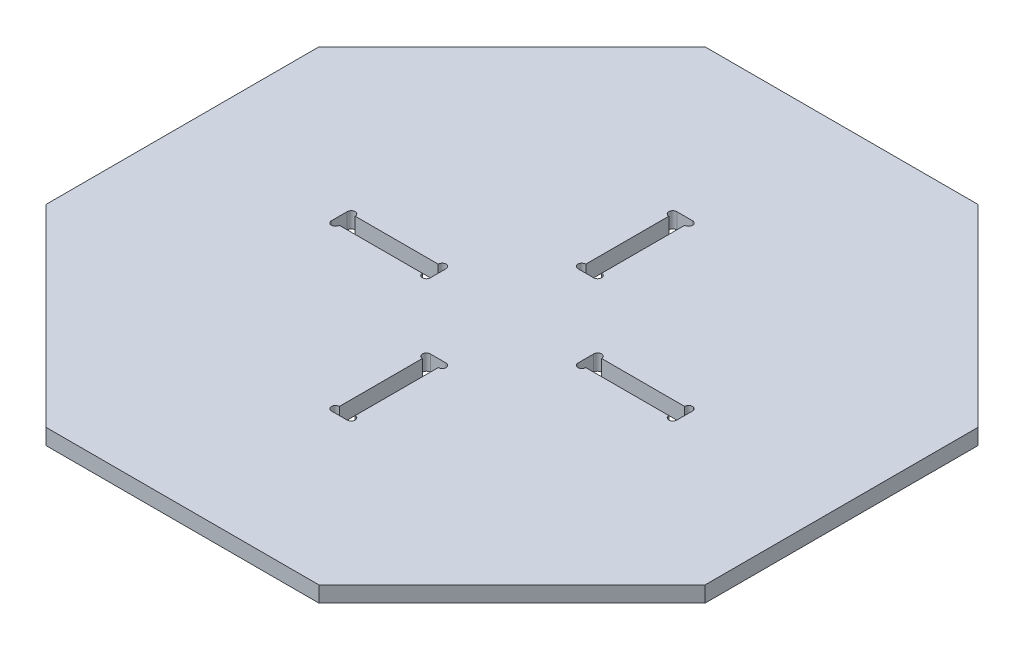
ISO-10303-21;
HEADER;
FILE_DESCRIPTION(('STEP AP214'),'2;1');
FILE_NAME('part.step','',(''),(''),'','','');
FILE_SCHEMA(('AUTOMOTIVE_DESIGN { 1 0 10303 214 1 1 1 1 }'));
ENDSEC;
DATA;
#1=APPLICATION_CONTEXT('core data for automotive mechanical design processes');
#2=APPLICATION_PROTOCOL_DEFINITION('international standard','automotive_design',2000,#1);
#3=PRODUCT_CONTEXT('',#1,'mechanical');
#4=PRODUCT('Part','Part','',(#3));
#5=PRODUCT_RELATED_PRODUCT_CATEGORY('part','',(#4));
#6=PRODUCT_DEFINITION_FORMATION('','',#4);
#7=PRODUCT_DEFINITION_CONTEXT('part definition',#1,'design');
#8=PRODUCT_DEFINITION('design','',#6,#7);
#9=PRODUCT_DEFINITION_SHAPE('','',#8);
#10=(LENGTH_UNIT() NAMED_UNIT(*) SI_UNIT(.MILLI.,.METRE.));
#11=(NAMED_UNIT(*) PLANE_ANGLE_UNIT() SI_UNIT($,.RADIAN.));
#12=(NAMED_UNIT(*) SI_UNIT($,.STERADIAN.) SOLID_ANGLE_UNIT());
#13=UNCERTAINTY_MEASURE_WITH_UNIT(LENGTH_MEASURE(1.E-05),#10,'distance_accuracy_value','');
#14=(GEOMETRIC_REPRESENTATION_CONTEXT(3) GLOBAL_UNCERTAINTY_ASSIGNED_CONTEXT((#13)) GLOBAL_UNIT_ASSIGNED_CONTEXT((#10,
#11,#12)) REPRESENTATION_CONTEXT('',''));
#15=CARTESIAN_POINT('',(0.,0.,0.));
#16=DIRECTION('',(0.,0.,1.));
#17=DIRECTION('',(1.,0.,0.));
#18=AXIS2_PLACEMENT_3D('',#15,#16,#17);
#19=CARTESIAN_POINT('',(0.,12.,0.));
#20=DIRECTION('',(0.,1.,0.));
#21=DIRECTION('',(0.,0.,1.));
#22=AXIS2_PLACEMENT_3D('',#19,#20,#21);
#23=PLANE('',#22);
#24=DIRECTION('',(1.,0.,0.));
#25=VECTOR('',#24,1.);
#26=CARTESIAN_POINT('',(-103.553390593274,12.,250.));
#27=LINE('',#26,#25);
#28=CARTESIAN_POINT('',(-103.553390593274,12.,250.));
#29=VERTEX_POINT('',#28);
#30=CARTESIAN_POINT('',(103.553390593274,12.,250.));
#31=VERTEX_POINT('',#30);
#32=EDGE_CURVE('E536',#29,#31,#27,.T.);
#33=ORIENTED_EDGE('',*,*,#32,.T.);
#34=DIRECTION('',(0.707106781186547,0.,-0.707106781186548));
#35=VECTOR('',#34,1.);
#36=CARTESIAN_POINT('',(103.553390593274,12.,250.));
#37=LINE('',#36,#35);
#38=CARTESIAN_POINT('',(250.,12.,103.553390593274));
#39=VERTEX_POINT('',#38);
#40=EDGE_CURVE('E539',#31,#39,#37,.T.);
#41=ORIENTED_EDGE('',*,*,#40,.T.);
#42=DIRECTION('',(0.,0.,-1.));
#43=VECTOR('',#42,1.);
#44=CARTESIAN_POINT('',(250.,12.,103.553390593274));
#45=LINE('',#44,#43);
#46=CARTESIAN_POINT('',(250.,12.,-103.553390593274));
#47=VERTEX_POINT('',#46);
#48=EDGE_CURVE('E542',#39,#47,#45,.T.);
#49=ORIENTED_EDGE('',*,*,#48,.T.);
#50=DIRECTION('',(-0.707106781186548,0.,-0.707106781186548));
#51=VECTOR('',#50,1.);
#52=CARTESIAN_POINT('',(250.,12.,-103.553390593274));
#53=LINE('',#52,#51);
#54=CARTESIAN_POINT('',(103.553390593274,12.,-250.));
#55=VERTEX_POINT('',#54);
#56=EDGE_CURVE('E544',#47,#55,#53,.T.);
#57=ORIENTED_EDGE('',*,*,#56,.T.);
#58=DIRECTION('',(-1.,0.,0.));
#59=VECTOR('',#58,1.);
#60=CARTESIAN_POINT('',(103.553390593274,12.,-250.));
#61=LINE('',#60,#59);
#62=CARTESIAN_POINT('',(-103.553390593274,12.,-250.));
#63=VERTEX_POINT('',#62);
#64=EDGE_CURVE('E546',#55,#63,#61,.T.);
#65=ORIENTED_EDGE('',*,*,#64,.T.);
#66=DIRECTION('',(-0.707106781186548,0.,0.707106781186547));
#67=VECTOR('',#66,1.);
#68=CARTESIAN_POINT('',(-103.553390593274,12.,-250.));
#69=LINE('',#68,#67);
#70=CARTESIAN_POINT('',(-250.,12.,-103.553390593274));
#71=VERTEX_POINT('',#70);
#72=EDGE_CURVE('E548',#63,#71,#69,.T.);
#73=ORIENTED_EDGE('',*,*,#72,.T.);
#74=DIRECTION('',(0.,0.,1.));
#75=VECTOR('',#74,1.);
#76=CARTESIAN_POINT('',(-250.,12.,-103.553390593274));
#77=LINE('',#76,#75);
#78=CARTESIAN_POINT('',(-250.,12.,103.553390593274));
#79=VERTEX_POINT('',#78);
#80=EDGE_CURVE('E550',#71,#79,#77,.T.);
#81=ORIENTED_EDGE('',*,*,#80,.T.);
#82=DIRECTION('',(0.707106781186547,0.,0.707106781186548));
#83=VECTOR('',#82,1.);
#84=CARTESIAN_POINT('',(-250.,12.,103.553390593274));
#85=LINE('',#84,#83);
#86=EDGE_CURVE('E552',#79,#29,#85,.T.);
#87=ORIENTED_EDGE('',*,*,#86,.T.);
#88=EDGE_LOOP('',(#33,#41,#49,#57,#65,#73,#81,#87));
#89=FACE_BOUND('',#88,.T.);
#90=DIRECTION('',(0.,0.,1.));
#91=VECTOR('',#90,1.);
#92=CARTESIAN_POINT('',(-6.00000000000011,12.,-62.));
#93=LINE('',#92,#91);
#94=CARTESIAN_POINT('',(-6.00000000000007,12.,-125.));
#95=VERTEX_POINT('',#94);
#96=CARTESIAN_POINT('',(-6.00000000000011,12.,-62.));
#97=VERTEX_POINT('',#96);
#98=EDGE_CURVE('E479',#95,#97,#93,.T.);
#99=ORIENTED_EDGE('',*,*,#98,.F.);
#100=CARTESIAN_POINT('',(-6.00000000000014,12.,-128.));
#101=DIRECTION('',(0.,1.,0.));
#102=DIRECTION('',(0.,0.,-1.));
#103=AXIS2_PLACEMENT_3D('',#100,#101,#102);
#104=CIRCLE('',#103,2.99999999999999);
#105=CARTESIAN_POINT('',(-6.00000000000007,12.,-131.));
#106=VERTEX_POINT('',#105);
#107=EDGE_CURVE('E477',#106,#95,#104,.T.);
#108=ORIENTED_EDGE('',*,*,#107,.F.);
#109=DIRECTION('',(-1.,0.,0.));
#110=VECTOR('',#109,1.);
#111=CARTESIAN_POINT('',(-6.00000000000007,12.,-131.));
#112=LINE('',#111,#110);
#113=CARTESIAN_POINT('',(5.99999999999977,12.,-131.));
#114=VERTEX_POINT('',#113);
#115=EDGE_CURVE('E493',#114,#106,#112,.T.);
#116=ORIENTED_EDGE('',*,*,#115,.F.);
#117=CARTESIAN_POINT('',(5.99999999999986,12.,-128.));
#118=DIRECTION('',(0.,1.,0.));
#119=DIRECTION('',(0.,0.,-1.));
#120=AXIS2_PLACEMENT_3D('',#117,#118,#119);
#121=CIRCLE('',#120,2.99999999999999);
#122=CARTESIAN_POINT('',(5.99999999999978,12.,-125.));
#123=VERTEX_POINT('',#122);
#124=EDGE_CURVE('E490',#123,#114,#121,.T.);
#125=ORIENTED_EDGE('',*,*,#124,.F.);
#126=DIRECTION('',(0.,0.,-1.));
#127=VECTOR('',#126,1.);
#128=CARTESIAN_POINT('',(5.99999999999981,12.,-62.));
#129=LINE('',#128,#127);
#130=CARTESIAN_POINT('',(5.99999999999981,12.,-62.));
#131=VERTEX_POINT('',#130);
#132=EDGE_CURVE('E488',#131,#123,#129,.T.);
#133=ORIENTED_EDGE('',*,*,#132,.F.);
#134=CARTESIAN_POINT('',(5.99999999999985,12.,-59.));
#135=DIRECTION('',(0.,1.,0.));
#136=DIRECTION('',(0.,0.,-1.));
#137=AXIS2_PLACEMENT_3D('',#134,#135,#136);
#138=CIRCLE('',#137,3.00000000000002);
#139=CARTESIAN_POINT('',(5.99999999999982,12.,-56.));
#140=VERTEX_POINT('',#139);
#141=EDGE_CURVE('E486',#140,#131,#138,.T.);
#142=ORIENTED_EDGE('',*,*,#141,.F.);
#143=DIRECTION('',(1.,0.,0.));
#144=VECTOR('',#143,1.);
#145=CARTESIAN_POINT('',(-6.00000000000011,12.,-56.));
#146=LINE('',#145,#144);
#147=CARTESIAN_POINT('',(-6.00000000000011,12.,-56.));
#148=VERTEX_POINT('',#147);
#149=EDGE_CURVE('E484',#148,#140,#146,.T.);
#150=ORIENTED_EDGE('',*,*,#149,.F.);
#151=CARTESIAN_POINT('',(-6.00000000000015,12.,-59.));
#152=DIRECTION('',(0.,1.,0.));
#153=DIRECTION('',(0.,0.,-1.));
#154=AXIS2_PLACEMENT_3D('',#151,#152,#153);
#155=CIRCLE('',#154,3.00000000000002);
#156=EDGE_CURVE('E482',#97,#148,#155,.T.);
#157=ORIENTED_EDGE('',*,*,#156,.F.);
#158=EDGE_LOOP('',(#99,#108,#116,#125,#133,#142,#150,#157));
#159=FACE_BOUND('',#158,.T.);
#160=DIRECTION('',(1.,0.,0.));
#161=VECTOR('',#160,1.);
#162=CARTESIAN_POINT('',(62.,12.,5.99999999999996));
#163=LINE('',#162,#161);
#164=CARTESIAN_POINT('',(62.,12.,5.99999999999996));
#165=VERTEX_POINT('',#164);
#166=CARTESIAN_POINT('',(125.,12.,5.99999999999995));
#167=VERTEX_POINT('',#166);
#168=EDGE_CURVE('E420',#165,#167,#163,.T.);
#169=ORIENTED_EDGE('',*,*,#168,.F.);
#170=CARTESIAN_POINT('',(59.,12.,5.99999999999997));
#171=DIRECTION('',(0.,1.,0.));
#172=DIRECTION('',(0.,0.,1.));
#173=AXIS2_PLACEMENT_3D('',#170,#171,#172);
#174=CIRCLE('',#173,3.);
#175=CARTESIAN_POINT('',(56.,12.,5.99999999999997));
#176=VERTEX_POINT('',#175);
#177=EDGE_CURVE('E418',#176,#165,#174,.T.);
#178=ORIENTED_EDGE('',*,*,#177,.F.);
#179=DIRECTION('',(0.,0.,1.));
#180=VECTOR('',#179,1.);
#181=CARTESIAN_POINT('',(56.,12.,5.99999999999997));
#182=LINE('',#181,#180);
#183=CARTESIAN_POINT('',(56.,12.,-6.00000000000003));
#184=VERTEX_POINT('',#183);
#185=EDGE_CURVE('E434',#184,#176,#182,.T.);
#186=ORIENTED_EDGE('',*,*,#185,.F.);
#187=CARTESIAN_POINT('',(59.,12.,-6.00000000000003));
#188=DIRECTION('',(0.,1.,0.));
#189=DIRECTION('',(0.,0.,1.));
#190=AXIS2_PLACEMENT_3D('',#187,#188,#189);
#191=CIRCLE('',#190,3.00000000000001);
#192=CARTESIAN_POINT('',(62.,12.,-6.00000000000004));
#193=VERTEX_POINT('',#192);
#194=EDGE_CURVE('E431',#193,#184,#191,.T.);
#195=ORIENTED_EDGE('',*,*,#194,.F.);
#196=DIRECTION('',(-1.,0.,0.));
#197=VECTOR('',#196,1.);
#198=CARTESIAN_POINT('',(62.,12.,-6.00000000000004));
#199=LINE('',#198,#197);
#200=CARTESIAN_POINT('',(125.,12.,-6.00000000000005));
#201=VERTEX_POINT('',#200);
#202=EDGE_CURVE('E429',#201,#193,#199,.T.);
#203=ORIENTED_EDGE('',*,*,#202,.F.);
#204=CARTESIAN_POINT('',(128.,12.,-6.00000000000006));
#205=DIRECTION('',(0.,1.,0.));
#206=DIRECTION('',(0.,0.,1.));
#207=AXIS2_PLACEMENT_3D('',#204,#205,#206);
#208=CIRCLE('',#207,3.);
#209=CARTESIAN_POINT('',(131.,12.,-6.00000000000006));
#210=VERTEX_POINT('',#209);
#211=EDGE_CURVE('E427',#210,#201,#208,.T.);
#212=ORIENTED_EDGE('',*,*,#211,.F.);
#213=DIRECTION('',(0.,0.,-1.));
#214=VECTOR('',#213,1.);
#215=CARTESIAN_POINT('',(131.,12.,5.99999999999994));
#216=LINE('',#215,#214);
#217=CARTESIAN_POINT('',(131.,12.,5.99999999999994));
#218=VERTEX_POINT('',#217);
#219=EDGE_CURVE('E425',#218,#210,#216,.T.);
#220=ORIENTED_EDGE('',*,*,#219,.F.);
#221=CARTESIAN_POINT('',(128.,12.,5.99999999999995));
#222=DIRECTION('',(0.,1.,0.));
#223=DIRECTION('',(0.,0.,1.));
#224=AXIS2_PLACEMENT_3D('',#221,#222,#223);
#225=CIRCLE('',#224,3.);
#226=EDGE_CURVE('E423',#167,#218,#225,.T.);
#227=ORIENTED_EDGE('',*,*,#226,.F.);
#228=EDGE_LOOP('',(#169,#178,#186,#195,#203,#212,#220,#227));
#229=FACE_BOUND('',#228,.T.);
#230=DIRECTION('',(0.,0.,-1.));
#231=VECTOR('',#230,1.);
#232=CARTESIAN_POINT('',(-56.,12.,6.00000000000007));
#233=LINE('',#232,#231);
#234=CARTESIAN_POINT('',(-56.,12.,6.00000000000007));
#235=VERTEX_POINT('',#234);
#236=CARTESIAN_POINT('',(-56.,12.,-5.99999999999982));
#237=VERTEX_POINT('',#236);
#238=EDGE_CURVE('E361',#235,#237,#233,.T.);
#239=ORIENTED_EDGE('',*,*,#238,.F.);
#240=CARTESIAN_POINT('',(-59.,12.,6.00000000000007));
#241=DIRECTION('',(0.,1.,0.));
#242=DIRECTION('',(0.,0.,-1.));
#243=AXIS2_PLACEMENT_3D('',#240,#241,#242);
#244=CIRCLE('',#243,3.);
#245=CARTESIAN_POINT('',(-62.,12.,6.00000000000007));
#246=VERTEX_POINT('',#245);
#247=EDGE_CURVE('E359',#246,#235,#244,.T.);
#248=ORIENTED_EDGE('',*,*,#247,.F.);
#249=DIRECTION('',(1.,0.,0.));
#250=VECTOR('',#249,1.);
#251=CARTESIAN_POINT('',(-62.,12.,6.00000000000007));
#252=LINE('',#251,#250);
#253=CARTESIAN_POINT('',(-125.,12.,6.00000000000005));
#254=VERTEX_POINT('',#253);
#255=EDGE_CURVE('E375',#254,#246,#252,.T.);
#256=ORIENTED_EDGE('',*,*,#255,.F.);
#257=CARTESIAN_POINT('',(-128.,12.,6.00000000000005));
#258=DIRECTION('',(0.,1.,0.));
#259=DIRECTION('',(0.,0.,-1.));
#260=AXIS2_PLACEMENT_3D('',#257,#258,#259);
#261=CIRCLE('',#260,3.);
#262=CARTESIAN_POINT('',(-131.,12.,6.00000000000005));
#263=VERTEX_POINT('',#262);
#264=EDGE_CURVE('E372',#263,#254,#261,.T.);
#265=ORIENTED_EDGE('',*,*,#264,.F.);
#266=DIRECTION('',(0.,0.,1.));
#267=VECTOR('',#266,1.);
#268=CARTESIAN_POINT('',(-131.,12.,6.00000000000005));
#269=LINE('',#268,#267);
#270=CARTESIAN_POINT('',(-131.,12.,-5.99999999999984));
#271=VERTEX_POINT('',#270);
#272=EDGE_CURVE('E370',#271,#263,#269,.T.);
#273=ORIENTED_EDGE('',*,*,#272,.F.);
#274=CARTESIAN_POINT('',(-128.,12.,-5.99999999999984));
#275=DIRECTION('',(0.,1.,0.));
#276=DIRECTION('',(0.,0.,-1.));
#277=AXIS2_PLACEMENT_3D('',#274,#275,#276);
#278=CIRCLE('',#277,3.);
#279=CARTESIAN_POINT('',(-125.,12.,-5.99999999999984));
#280=VERTEX_POINT('',#279);
#281=EDGE_CURVE('E368',#280,#271,#278,.T.);
#282=ORIENTED_EDGE('',*,*,#281,.F.);
#283=DIRECTION('',(-1.,0.,0.));
#284=VECTOR('',#283,1.);
#285=CARTESIAN_POINT('',(-62.,12.,-5.99999999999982));
#286=LINE('',#285,#284);
#287=CARTESIAN_POINT('',(-62.0000000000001,12.,-5.99999999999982));
#288=VERTEX_POINT('',#287);
#289=EDGE_CURVE('E366',#288,#280,#286,.T.);
#290=ORIENTED_EDGE('',*,*,#289,.F.);
#291=CARTESIAN_POINT('',(-59.,12.,-5.99999999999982));
#292=DIRECTION('',(0.,1.,0.));
#293=DIRECTION('',(0.,0.,-1.));
#294=AXIS2_PLACEMENT_3D('',#291,#292,#293);
#295=CIRCLE('',#294,3.00000000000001);
#296=EDGE_CURVE('E364',#237,#288,#295,.T.);
#297=ORIENTED_EDGE('',*,*,#296,.F.);
#298=EDGE_LOOP('',(#239,#248,#256,#265,#273,#282,#290,#297));
#299=FACE_BOUND('',#298,.T.);
#300=DIRECTION('',(1.,0.,0.));
#301=VECTOR('',#300,1.);
#302=CARTESIAN_POINT('',(-5.99999999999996,12.,131.));
#303=LINE('',#302,#301);
#304=CARTESIAN_POINT('',(-5.99999999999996,12.,131.));
#305=VERTEX_POINT('',#304);
#306=CARTESIAN_POINT('',(5.99999999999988,12.,131.));
#307=VERTEX_POINT('',#306);
#308=EDGE_CURVE('E302',#305,#307,#303,.T.);
#309=ORIENTED_EDGE('',*,*,#308,.F.);
#310=CARTESIAN_POINT('',(-6.00000000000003,12.,128.));
#311=DIRECTION('',(0.,1.,0.));
#312=DIRECTION('',(0.,0.,1.));
#313=AXIS2_PLACEMENT_3D('',#310,#311,#312);
#314=CIRCLE('',#313,2.99999999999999);
#315=CARTESIAN_POINT('',(-5.99999999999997,12.,125.));
#316=VERTEX_POINT('',#315);
#317=EDGE_CURVE('E294',#316,#305,#314,.T.);
#318=ORIENTED_EDGE('',*,*,#317,.F.);
#319=DIRECTION('',(0.,0.,1.));
#320=VECTOR('',#319,1.);
#321=CARTESIAN_POINT('',(-6.,12.,62.));
#322=LINE('',#321,#320);
#323=CARTESIAN_POINT('',(-6.,12.,62.));
#324=VERTEX_POINT('',#323);
#325=EDGE_CURVE('E327',#324,#316,#322,.T.);
#326=ORIENTED_EDGE('',*,*,#325,.F.);
#327=CARTESIAN_POINT('',(-6.00000000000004,12.,59.));
#328=DIRECTION('',(0.,1.,0.));
#329=DIRECTION('',(0.,0.,1.));
#330=AXIS2_PLACEMENT_3D('',#327,#328,#329);
#331=CIRCLE('',#330,3.00000000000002);
#332=CARTESIAN_POINT('',(-6.00000000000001,12.,56.));
#333=VERTEX_POINT('',#332);
#334=EDGE_CURVE('E325',#333,#324,#331,.T.);
#335=ORIENTED_EDGE('',*,*,#334,.F.);
#336=DIRECTION('',(-1.,0.,0.));
#337=VECTOR('',#336,1.);
#338=CARTESIAN_POINT('',(-6.00000000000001,12.,56.));
#339=LINE('',#338,#337);
#340=CARTESIAN_POINT('',(5.99999999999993,12.,56.));
#341=VERTEX_POINT('',#340);
#342=EDGE_CURVE('E323',#341,#333,#339,.T.);
#343=ORIENTED_EDGE('',*,*,#342,.F.);
#344=CARTESIAN_POINT('',(5.99999999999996,12.,59.));
#345=DIRECTION('',(0.,1.,0.));
#346=DIRECTION('',(0.,0.,1.));
#347=AXIS2_PLACEMENT_3D('',#344,#345,#346);
#348=CIRCLE('',#347,3.00000000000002);
#349=CARTESIAN_POINT('',(5.99999999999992,12.,62.));
#350=VERTEX_POINT('',#349);
#351=EDGE_CURVE('E321',#350,#341,#348,.T.);
#352=ORIENTED_EDGE('',*,*,#351,.F.);
#353=DIRECTION('',(0.,0.,-1.));
#354=VECTOR('',#353,1.);
#355=CARTESIAN_POINT('',(5.99999999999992,12.,62.));
#356=LINE('',#355,#354);
#357=CARTESIAN_POINT('',(5.99999999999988,12.,125.));
#358=VERTEX_POINT('',#357);
#359=EDGE_CURVE('E317',#358,#350,#356,.T.);
#360=ORIENTED_EDGE('',*,*,#359,.F.);
#361=CARTESIAN_POINT('',(5.99999999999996,12.,128.));
#362=DIRECTION('',(0.,1.,0.));
#363=DIRECTION('',(0.,0.,1.));
#364=AXIS2_PLACEMENT_3D('',#361,#362,#363);
#365=CIRCLE('',#364,2.99999999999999);
#366=EDGE_CURVE('E315',#307,#358,#365,.T.);
#367=ORIENTED_EDGE('',*,*,#366,.F.);
#368=EDGE_LOOP('',(#309,#318,#326,#335,#343,#352,#360,#367));
#369=FACE_BOUND('',#368,.T.);
#370=ADVANCED_FACE('F37',(#89,#159,#229,#299,#369),#23,.T.);
#371=CARTESIAN_POINT('',(0.,0.,0.));
#372=DIRECTION('',(0.,1.,0.));
#373=DIRECTION('',(0.,0.,1.));
#374=AXIS2_PLACEMENT_3D('',#371,#372,#373);
#375=PLANE('',#374);
#376=CARTESIAN_POINT('',(-59.,0.,6.00000000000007));
#377=DIRECTION('',(0.,1.,0.));
#378=DIRECTION('',(0.,0.,-1.));
#379=AXIS2_PLACEMENT_3D('',#376,#377,#378);
#380=CIRCLE('',#379,3.);
#381=CARTESIAN_POINT('',(-62.,0.,6.00000000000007));
#382=VERTEX_POINT('',#381);
#383=CARTESIAN_POINT('',(-56.,0.,6.00000000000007));
#384=VERTEX_POINT('',#383);
#385=EDGE_CURVE('E310',#382,#384,#380,.T.);
#386=ORIENTED_EDGE('',*,*,#385,.T.);
#387=DIRECTION('',(0.,0.,-1.));
#388=VECTOR('',#387,1.);
#389=CARTESIAN_POINT('',(-56.,0.,6.00000000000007));
#390=LINE('',#389,#388);
#391=CARTESIAN_POINT('',(-56.,0.,-5.99999999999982));
#392=VERTEX_POINT('',#391);
#393=EDGE_CURVE('E380',#384,#392,#390,.T.);
#394=ORIENTED_EDGE('',*,*,#393,.T.);
#395=CARTESIAN_POINT('',(-59.,0.,-5.99999999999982));
#396=DIRECTION('',(0.,1.,0.));
#397=DIRECTION('',(0.,0.,-1.));
#398=AXIS2_PLACEMENT_3D('',#395,#396,#397);
#399=CIRCLE('',#398,3.00000000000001);
#400=CARTESIAN_POINT('',(-62.0000000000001,0.,-5.99999999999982));
#401=VERTEX_POINT('',#400);
#402=EDGE_CURVE('E383',#392,#401,#399,.T.);
#403=ORIENTED_EDGE('',*,*,#402,.T.);
#404=DIRECTION('',(-1.,0.,0.));
#405=VECTOR('',#404,1.);
#406=CARTESIAN_POINT('',(-62.,0.,-5.99999999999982));
#407=LINE('',#406,#405);
#408=CARTESIAN_POINT('',(-125.,0.,-5.99999999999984));
#409=VERTEX_POINT('',#408);
#410=EDGE_CURVE('E386',#401,#409,#407,.T.);
#411=ORIENTED_EDGE('',*,*,#410,.T.);
#412=CARTESIAN_POINT('',(-128.,0.,-5.99999999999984));
#413=DIRECTION('',(0.,1.,0.));
#414=DIRECTION('',(0.,0.,-1.));
#415=AXIS2_PLACEMENT_3D('',#412,#413,#414);
#416=CIRCLE('',#415,3.);
#417=CARTESIAN_POINT('',(-131.,0.,-5.99999999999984));
#418=VERTEX_POINT('',#417);
#419=EDGE_CURVE('E389',#409,#418,#416,.T.);
#420=ORIENTED_EDGE('',*,*,#419,.T.);
#421=DIRECTION('',(0.,0.,1.));
#422=VECTOR('',#421,1.);
#423=CARTESIAN_POINT('',(-131.,0.,6.00000000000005));
#424=LINE('',#423,#422);
#425=CARTESIAN_POINT('',(-131.,0.,6.00000000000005));
#426=VERTEX_POINT('',#425);
#427=EDGE_CURVE('E392',#418,#426,#424,.T.);
#428=ORIENTED_EDGE('',*,*,#427,.T.);
#429=CARTESIAN_POINT('',(-128.,0.,6.00000000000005));
#430=DIRECTION('',(0.,1.,0.));
#431=DIRECTION('',(0.,0.,-1.));
#432=AXIS2_PLACEMENT_3D('',#429,#430,#431);
#433=CIRCLE('',#432,3.);
#434=CARTESIAN_POINT('',(-125.,0.,6.00000000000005));
#435=VERTEX_POINT('',#434);
#436=EDGE_CURVE('E395',#426,#435,#433,.T.);
#437=ORIENTED_EDGE('',*,*,#436,.T.);
#438=DIRECTION('',(1.,0.,0.));
#439=VECTOR('',#438,1.);
#440=CARTESIAN_POINT('',(-62.,0.,6.00000000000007));
#441=LINE('',#440,#439);
#442=EDGE_CURVE('E362',#435,#382,#441,.T.);
#443=ORIENTED_EDGE('',*,*,#442,.T.);
#444=EDGE_LOOP('',(#386,#394,#403,#411,#420,#428,#437,#443));
#445=FACE_BOUND('',#444,.T.);
#446=CARTESIAN_POINT('',(-6.00000000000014,0.,-128.));
#447=DIRECTION('',(0.,1.,0.));
#448=DIRECTION('',(0.,0.,-1.));
#449=AXIS2_PLACEMENT_3D('',#446,#447,#448);
#450=CIRCLE('',#449,2.99999999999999);
#451=CARTESIAN_POINT('',(-6.00000000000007,0.,-131.));
#452=VERTEX_POINT('',#451);
#453=CARTESIAN_POINT('',(-6.00000000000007,0.,-125.));
#454=VERTEX_POINT('',#453);
#455=EDGE_CURVE('E476',#452,#454,#450,.T.);
#456=ORIENTED_EDGE('',*,*,#455,.T.);
#457=DIRECTION('',(0.,0.,1.));
#458=VECTOR('',#457,1.);
#459=CARTESIAN_POINT('',(-6.00000000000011,0.,-62.));
#460=LINE('',#459,#458);
#461=CARTESIAN_POINT('',(-6.00000000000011,0.,-62.));
#462=VERTEX_POINT('',#461);
#463=EDGE_CURVE('E498',#454,#462,#460,.T.);
#464=ORIENTED_EDGE('',*,*,#463,.T.);
#465=CARTESIAN_POINT('',(-6.00000000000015,0.,-59.));
#466=DIRECTION('',(0.,1.,0.));
#467=DIRECTION('',(0.,0.,-1.));
#468=AXIS2_PLACEMENT_3D('',#465,#466,#467);
#469=CIRCLE('',#468,3.00000000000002);
#470=CARTESIAN_POINT('',(-6.00000000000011,0.,-56.));
#471=VERTEX_POINT('',#470);
#472=EDGE_CURVE('E501',#462,#471,#469,.T.);
#473=ORIENTED_EDGE('',*,*,#472,.T.);
#474=DIRECTION('',(1.,0.,0.));
#475=VECTOR('',#474,1.);
#476=CARTESIAN_POINT('',(-6.00000000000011,0.,-56.));
#477=LINE('',#476,#475);
#478=CARTESIAN_POINT('',(5.99999999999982,0.,-56.));
#479=VERTEX_POINT('',#478);
#480=EDGE_CURVE('E504',#471,#479,#477,.T.);
#481=ORIENTED_EDGE('',*,*,#480,.T.);
#482=CARTESIAN_POINT('',(5.99999999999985,0.,-59.));
#483=DIRECTION('',(0.,1.,0.));
#484=DIRECTION('',(0.,0.,-1.));
#485=AXIS2_PLACEMENT_3D('',#482,#483,#484);
#486=CIRCLE('',#485,3.00000000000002);
#487=CARTESIAN_POINT('',(5.99999999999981,0.,-62.));
#488=VERTEX_POINT('',#487);
#489=EDGE_CURVE('E507',#479,#488,#486,.T.);
#490=ORIENTED_EDGE('',*,*,#489,.T.);
#491=DIRECTION('',(0.,0.,-1.));
#492=VECTOR('',#491,1.);
#493=CARTESIAN_POINT('',(5.99999999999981,0.,-62.));
#494=LINE('',#493,#492);
#495=CARTESIAN_POINT('',(5.99999999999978,0.,-125.));
#496=VERTEX_POINT('',#495);
#497=EDGE_CURVE('E510',#488,#496,#494,.T.);
#498=ORIENTED_EDGE('',*,*,#497,.T.);
#499=CARTESIAN_POINT('',(5.99999999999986,0.,-128.));
#500=DIRECTION('',(0.,1.,0.));
#501=DIRECTION('',(0.,0.,-1.));
#502=AXIS2_PLACEMENT_3D('',#499,#500,#501);
#503=CIRCLE('',#502,2.99999999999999);
#504=CARTESIAN_POINT('',(5.99999999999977,0.,-131.));
#505=VERTEX_POINT('',#504);
#506=EDGE_CURVE('E513',#496,#505,#503,.T.);
#507=ORIENTED_EDGE('',*,*,#506,.T.);
#508=DIRECTION('',(-1.,0.,0.));
#509=VECTOR('',#508,1.);
#510=CARTESIAN_POINT('',(-6.00000000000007,0.,-131.));
#511=LINE('',#510,#509);
#512=EDGE_CURVE('E480',#505,#452,#511,.T.);
#513=ORIENTED_EDGE('',*,*,#512,.T.);
#514=EDGE_LOOP('',(#456,#464,#473,#481,#490,#498,#507,#513));
#515=FACE_BOUND('',#514,.T.);
#516=DIRECTION('',(1.,0.,0.));
#517=VECTOR('',#516,1.);
#518=CARTESIAN_POINT('',(-103.553390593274,0.,250.));
#519=LINE('',#518,#517);
#520=CARTESIAN_POINT('',(-103.553390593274,0.,250.));
#521=VERTEX_POINT('',#520);
#522=CARTESIAN_POINT('',(103.553390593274,0.,250.));
#523=VERTEX_POINT('',#522);
#524=EDGE_CURVE('E535',#521,#523,#519,.T.);
#525=ORIENTED_EDGE('',*,*,#524,.F.);
#526=DIRECTION('',(0.707106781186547,0.,0.707106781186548));
#527=VECTOR('',#526,1.);
#528=CARTESIAN_POINT('',(-250.,0.,103.553390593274));
#529=LINE('',#528,#527);
#530=CARTESIAN_POINT('',(-250.,0.,103.553390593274));
#531=VERTEX_POINT('',#530);
#532=EDGE_CURVE('E540',#531,#521,#529,.T.);
#533=ORIENTED_EDGE('',*,*,#532,.F.);
#534=DIRECTION('',(0.,0.,1.));
#535=VECTOR('',#534,1.);
#536=CARTESIAN_POINT('',(-250.,0.,-103.553390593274));
#537=LINE('',#536,#535);
#538=CARTESIAN_POINT('',(-250.,0.,-103.553390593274));
#539=VERTEX_POINT('',#538);
#540=EDGE_CURVE('E567',#539,#531,#537,.T.);
#541=ORIENTED_EDGE('',*,*,#540,.F.);
#542=DIRECTION('',(-0.707106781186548,0.,0.707106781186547));
#543=VECTOR('',#542,1.);
#544=CARTESIAN_POINT('',(-103.553390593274,0.,-250.));
#545=LINE('',#544,#543);
#546=CARTESIAN_POINT('',(-103.553390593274,0.,-250.));
#547=VERTEX_POINT('',#546);
#548=EDGE_CURVE('E565',#547,#539,#545,.T.);
#549=ORIENTED_EDGE('',*,*,#548,.F.);
#550=DIRECTION('',(-1.,0.,0.));
#551=VECTOR('',#550,1.);
#552=CARTESIAN_POINT('',(103.553390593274,0.,-250.));
#553=LINE('',#552,#551);
#554=CARTESIAN_POINT('',(103.553390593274,0.,-250.));
#555=VERTEX_POINT('',#554);
#556=EDGE_CURVE('E563',#555,#547,#553,.T.);
#557=ORIENTED_EDGE('',*,*,#556,.F.);
#558=DIRECTION('',(-0.707106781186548,0.,-0.707106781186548));
#559=VECTOR('',#558,1.);
#560=CARTESIAN_POINT('',(250.,0.,-103.553390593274));
#561=LINE('',#560,#559);
#562=CARTESIAN_POINT('',(250.,0.,-103.553390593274));
#563=VERTEX_POINT('',#562);
#564=EDGE_CURVE('E561',#563,#555,#561,.T.);
#565=ORIENTED_EDGE('',*,*,#564,.F.);
#566=DIRECTION('',(0.,0.,-1.));
#567=VECTOR('',#566,1.);
#568=CARTESIAN_POINT('',(250.,0.,103.553390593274));
#569=LINE('',#568,#567);
#570=CARTESIAN_POINT('',(250.,0.,103.553390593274));
#571=VERTEX_POINT('',#570);
#572=EDGE_CURVE('E559',#571,#563,#569,.T.);
#573=ORIENTED_EDGE('',*,*,#572,.F.);
#574=DIRECTION('',(0.707106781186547,0.,-0.707106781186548));
#575=VECTOR('',#574,1.);
#576=CARTESIAN_POINT('',(103.553390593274,0.,250.));
#577=LINE('',#576,#575);
#578=EDGE_CURVE('E557',#523,#571,#577,.T.);
#579=ORIENTED_EDGE('',*,*,#578,.F.);
#580=EDGE_LOOP('',(#525,#533,#541,#549,#557,#565,#573,#579));
#581=FACE_BOUND('',#580,.T.);
#582=CARTESIAN_POINT('',(59.,0.,5.99999999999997));
#583=DIRECTION('',(0.,1.,0.));
#584=DIRECTION('',(0.,0.,1.));
#585=AXIS2_PLACEMENT_3D('',#582,#583,#584);
#586=CIRCLE('',#585,3.);
#587=CARTESIAN_POINT('',(56.,0.,5.99999999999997));
#588=VERTEX_POINT('',#587);
#589=CARTESIAN_POINT('',(62.,0.,5.99999999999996));
#590=VERTEX_POINT('',#589);
#591=EDGE_CURVE('E417',#588,#590,#586,.T.);
#592=ORIENTED_EDGE('',*,*,#591,.T.);
#593=DIRECTION('',(1.,0.,0.));
#594=VECTOR('',#593,1.);
#595=CARTESIAN_POINT('',(62.,0.,5.99999999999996));
#596=LINE('',#595,#594);
#597=CARTESIAN_POINT('',(125.,0.,5.99999999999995));
#598=VERTEX_POINT('',#597);
#599=EDGE_CURVE('E439',#590,#598,#596,.T.);
#600=ORIENTED_EDGE('',*,*,#599,.T.);
#601=CARTESIAN_POINT('',(128.,0.,5.99999999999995));
#602=DIRECTION('',(0.,1.,0.));
#603=DIRECTION('',(0.,0.,1.));
#604=AXIS2_PLACEMENT_3D('',#601,#602,#603);
#605=CIRCLE('',#604,3.);
#606=CARTESIAN_POINT('',(131.,0.,5.99999999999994));
#607=VERTEX_POINT('',#606);
#608=EDGE_CURVE('E442',#598,#607,#605,.T.);
#609=ORIENTED_EDGE('',*,*,#608,.T.);
#610=DIRECTION('',(0.,0.,-1.));
#611=VECTOR('',#610,1.);
#612=CARTESIAN_POINT('',(131.,0.,5.99999999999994));
#613=LINE('',#612,#611);
#614=CARTESIAN_POINT('',(131.,0.,-6.00000000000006));
#615=VERTEX_POINT('',#614);
#616=EDGE_CURVE('E445',#607,#615,#613,.T.);
#617=ORIENTED_EDGE('',*,*,#616,.T.);
#618=CARTESIAN_POINT('',(128.,0.,-6.00000000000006));
#619=DIRECTION('',(0.,1.,0.));
#620=DIRECTION('',(0.,0.,1.));
#621=AXIS2_PLACEMENT_3D('',#618,#619,#620);
#622=CIRCLE('',#621,3.);
#623=CARTESIAN_POINT('',(125.,0.,-6.00000000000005));
#624=VERTEX_POINT('',#623);
#625=EDGE_CURVE('E448',#615,#624,#622,.T.);
#626=ORIENTED_EDGE('',*,*,#625,.T.);
#627=DIRECTION('',(-1.,0.,0.));
#628=VECTOR('',#627,1.);
#629=CARTESIAN_POINT('',(62.,0.,-6.00000000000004));
#630=LINE('',#629,#628);
#631=CARTESIAN_POINT('',(62.,0.,-6.00000000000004));
#632=VERTEX_POINT('',#631);
#633=EDGE_CURVE('E451',#624,#632,#630,.T.);
#634=ORIENTED_EDGE('',*,*,#633,.T.);
#635=CARTESIAN_POINT('',(59.,0.,-6.00000000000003));
#636=DIRECTION('',(0.,1.,0.));
#637=DIRECTION('',(0.,0.,1.));
#638=AXIS2_PLACEMENT_3D('',#635,#636,#637);
#639=CIRCLE('',#638,3.00000000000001);
#640=CARTESIAN_POINT('',(56.,0.,-6.00000000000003));
#641=VERTEX_POINT('',#640);
#642=EDGE_CURVE('E454',#632,#641,#639,.T.);
#643=ORIENTED_EDGE('',*,*,#642,.T.);
#644=DIRECTION('',(0.,0.,1.));
#645=VECTOR('',#644,1.);
#646=CARTESIAN_POINT('',(56.,0.,5.99999999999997));
#647=LINE('',#646,#645);
#648=EDGE_CURVE('E421',#641,#588,#647,.T.);
#649=ORIENTED_EDGE('',*,*,#648,.T.);
#650=EDGE_LOOP('',(#592,#600,#609,#617,#626,#634,#643,#649));
#651=FACE_BOUND('',#650,.T.);
#652=CARTESIAN_POINT('',(-6.00000000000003,0.,128.));
#653=DIRECTION('',(0.,1.,0.));
#654=DIRECTION('',(0.,0.,1.));
#655=AXIS2_PLACEMENT_3D('',#652,#653,#654);
#656=CIRCLE('',#655,2.99999999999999);
#657=CARTESIAN_POINT('',(-5.99999999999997,0.,125.));
#658=VERTEX_POINT('',#657);
#659=CARTESIAN_POINT('',(-5.99999999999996,0.,131.));
#660=VERTEX_POINT('',#659);
#661=EDGE_CURVE('E60',#658,#660,#656,.T.);
#662=ORIENTED_EDGE('',*,*,#661,.T.);
#663=DIRECTION('',(1.,0.,0.));
#664=VECTOR('',#663,1.);
#665=CARTESIAN_POINT('',(-5.99999999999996,0.,131.));
#666=LINE('',#665,#664);
#667=CARTESIAN_POINT('',(5.99999999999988,0.,131.));
#668=VERTEX_POINT('',#667);
#669=EDGE_CURVE('E309',#660,#668,#666,.T.);
#670=ORIENTED_EDGE('',*,*,#669,.T.);
#671=CARTESIAN_POINT('',(5.99999999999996,0.,128.));
#672=DIRECTION('',(0.,1.,0.));
#673=DIRECTION('',(0.,0.,1.));
#674=AXIS2_PLACEMENT_3D('',#671,#672,#673);
#675=CIRCLE('',#674,2.99999999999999);
#676=CARTESIAN_POINT('',(5.99999999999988,0.,125.));
#677=VERTEX_POINT('',#676);
#678=EDGE_CURVE('E331',#668,#677,#675,.T.);
#679=ORIENTED_EDGE('',*,*,#678,.T.);
#680=DIRECTION('',(0.,0.,-1.));
#681=VECTOR('',#680,1.);
#682=CARTESIAN_POINT('',(5.99999999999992,0.,62.));
#683=LINE('',#682,#681);
#684=CARTESIAN_POINT('',(5.99999999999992,0.,62.));
#685=VERTEX_POINT('',#684);
#686=EDGE_CURVE('E334',#677,#685,#683,.T.);
#687=ORIENTED_EDGE('',*,*,#686,.T.);
#688=CARTESIAN_POINT('',(5.99999999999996,0.,59.));
#689=DIRECTION('',(0.,1.,0.));
#690=DIRECTION('',(0.,0.,1.));
#691=AXIS2_PLACEMENT_3D('',#688,#689,#690);
#692=CIRCLE('',#691,3.00000000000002);
#693=CARTESIAN_POINT('',(5.99999999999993,0.,56.));
#694=VERTEX_POINT('',#693);
#695=EDGE_CURVE('E337',#685,#694,#692,.T.);
#696=ORIENTED_EDGE('',*,*,#695,.T.);
#697=DIRECTION('',(-1.,0.,0.));
#698=VECTOR('',#697,1.);
#699=CARTESIAN_POINT('',(-6.00000000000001,0.,56.));
#700=LINE('',#699,#698);
#701=CARTESIAN_POINT('',(-6.00000000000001,0.,56.));
#702=VERTEX_POINT('',#701);
#703=EDGE_CURVE('E340',#694,#702,#700,.T.);
#704=ORIENTED_EDGE('',*,*,#703,.T.);
#705=CARTESIAN_POINT('',(-6.00000000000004,0.,59.));
#706=DIRECTION('',(0.,1.,0.));
#707=DIRECTION('',(0.,0.,1.));
#708=AXIS2_PLACEMENT_3D('',#705,#706,#707);
#709=CIRCLE('',#708,3.00000000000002);
#710=CARTESIAN_POINT('',(-6.00000000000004,0.,62.));
#711=VERTEX_POINT('',#710);
#712=EDGE_CURVE('E343',#702,#711,#709,.T.);
#713=ORIENTED_EDGE('',*,*,#712,.T.);
#714=DIRECTION('',(0.,0.,1.));
#715=VECTOR('',#714,1.);
#716=CARTESIAN_POINT('',(-6.,0.,62.));
#717=LINE('',#716,#715);
#718=EDGE_CURVE('E303',#711,#658,#717,.T.);
#719=ORIENTED_EDGE('',*,*,#718,.T.);
#720=EDGE_LOOP('',(#662,#670,#679,#687,#696,#704,#713,#719));
#721=FACE_BOUND('',#720,.T.);
#722=ADVANCED_FACE('F597',(#445,#515,#581,#651,#721),#375,.F.);
#723=CARTESIAN_POINT('',(-103.553390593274,12.,250.));
#724=DIRECTION('',(0.,0.,-1.));
#725=DIRECTION('',(-1.,0.,0.));
#726=AXIS2_PLACEMENT_3D('',#723,#724,#725);
#727=PLANE('',#726);
#728=ORIENTED_EDGE('',*,*,#524,.T.);
#729=DIRECTION('',(0.,-1.,0.));
#730=VECTOR('',#729,1.);
#731=CARTESIAN_POINT('',(103.553390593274,12.,250.));
#732=LINE('',#731,#730);
#733=EDGE_CURVE('E11',#31,#523,#732,.T.);
#734=ORIENTED_EDGE('',*,*,#733,.F.);
#735=ORIENTED_EDGE('',*,*,#32,.F.);
#736=DIRECTION('',(0.,-1.,0.));
#737=VECTOR('',#736,1.);
#738=CARTESIAN_POINT('',(-103.553390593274,12.,250.));
#739=LINE('',#738,#737);
#740=EDGE_CURVE('E554',#29,#521,#739,.T.);
#741=ORIENTED_EDGE('',*,*,#740,.T.);
#742=EDGE_LOOP('',(#728,#734,#735,#741));
#743=FACE_BOUND('',#742,.T.);
#744=ADVANCED_FACE('F39',(#743),#727,.F.);
#745=CARTESIAN_POINT('',(103.553390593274,12.,250.));
#746=DIRECTION('',(-0.707106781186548,0.,-0.707106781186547));
#747=DIRECTION('',(-0.707106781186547,0.,0.707106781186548));
#748=AXIS2_PLACEMENT_3D('',#745,#746,#747);
#749=PLANE('',#748);
#750=ORIENTED_EDGE('',*,*,#578,.T.);
#751=DIRECTION('',(0.,-1.,0.));
#752=VECTOR('',#751,1.);
#753=CARTESIAN_POINT('',(250.,12.,103.553390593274));
#754=LINE('',#753,#752);
#755=EDGE_CURVE('E45',#39,#571,#754,.T.);
#756=ORIENTED_EDGE('',*,*,#755,.F.);
#757=ORIENTED_EDGE('',*,*,#40,.F.);
#758=ORIENTED_EDGE('',*,*,#733,.T.);
#759=EDGE_LOOP('',(#750,#756,#757,#758));
#760=FACE_BOUND('',#759,.T.);
#761=ADVANCED_FACE('F615',(#760),#749,.F.);
#762=CARTESIAN_POINT('',(250.,12.,103.553390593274));
#763=DIRECTION('',(-1.,0.,0.));
#764=DIRECTION('',(0.,0.,1.));
#765=AXIS2_PLACEMENT_3D('',#762,#763,#764);
#766=PLANE('',#765);
#767=ORIENTED_EDGE('',*,*,#572,.T.);
#768=DIRECTION('',(0.,-1.,0.));
#769=VECTOR('',#768,1.);
#770=CARTESIAN_POINT('',(250.,12.,-103.553390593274));
#771=LINE('',#770,#769);
#772=EDGE_CURVE('E584',#47,#563,#771,.T.);
#773=ORIENTED_EDGE('',*,*,#772,.F.);
#774=ORIENTED_EDGE('',*,*,#48,.F.);
#775=ORIENTED_EDGE('',*,*,#755,.T.);
#776=EDGE_LOOP('',(#767,#773,#774,#775));
#777=FACE_BOUND('',#776,.T.);
#778=ADVANCED_FACE('F591',(#777),#766,.F.);
#779=CARTESIAN_POINT('',(250.,12.,-103.553390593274));
#780=DIRECTION('',(-0.707106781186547,0.,0.707106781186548));
#781=DIRECTION('',(0.707106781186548,0.,0.707106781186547));
#782=AXIS2_PLACEMENT_3D('',#779,#780,#781);
#783=PLANE('',#782);
#784=ORIENTED_EDGE('',*,*,#564,.T.);
#785=DIRECTION('',(0.,-1.,0.));
#786=VECTOR('',#785,1.);
#787=CARTESIAN_POINT('',(103.553390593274,12.,-250.));
#788=LINE('',#787,#786);
#789=EDGE_CURVE('E581',#55,#555,#788,.T.);
#790=ORIENTED_EDGE('',*,*,#789,.F.);
#791=ORIENTED_EDGE('',*,*,#56,.F.);
#792=ORIENTED_EDGE('',*,*,#772,.T.);
#793=EDGE_LOOP('',(#784,#790,#791,#792));
#794=FACE_BOUND('',#793,.T.);
#795=ADVANCED_FACE('F603',(#794),#783,.F.);
#796=CARTESIAN_POINT('',(103.553390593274,12.,-250.));
#797=DIRECTION('',(0.,0.,1.));
#798=DIRECTION('',(1.,0.,0.));
#799=AXIS2_PLACEMENT_3D('',#796,#797,#798);
#800=PLANE('',#799);
#801=ORIENTED_EDGE('',*,*,#556,.T.);
#802=DIRECTION('',(0.,-1.,0.));
#803=VECTOR('',#802,1.);
#804=CARTESIAN_POINT('',(-103.553390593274,12.,-250.));
#805=LINE('',#804,#803);
#806=EDGE_CURVE('E578',#63,#547,#805,.T.);
#807=ORIENTED_EDGE('',*,*,#806,.F.);
#808=ORIENTED_EDGE('',*,*,#64,.F.);
#809=ORIENTED_EDGE('',*,*,#789,.T.);
#810=EDGE_LOOP('',(#801,#807,#808,#809));
#811=FACE_BOUND('',#810,.T.);
#812=ADVANCED_FACE('F607',(#811),#800,.F.);
#813=CARTESIAN_POINT('',(-103.553390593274,12.,-250.));
#814=DIRECTION('',(0.707106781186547,0.,0.707106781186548));
#815=DIRECTION('',(0.707106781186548,0.,-0.707106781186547));
#816=AXIS2_PLACEMENT_3D('',#813,#814,#815);
#817=PLANE('',#816);
#818=ORIENTED_EDGE('',*,*,#548,.T.);
#819=DIRECTION('',(0.,-1.,0.));
#820=VECTOR('',#819,1.);
#821=CARTESIAN_POINT('',(-250.,12.,-103.553390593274));
#822=LINE('',#821,#820);
#823=EDGE_CURVE('E575',#71,#539,#822,.T.);
#824=ORIENTED_EDGE('',*,*,#823,.F.);
#825=ORIENTED_EDGE('',*,*,#72,.F.);
#826=ORIENTED_EDGE('',*,*,#806,.T.);
#827=EDGE_LOOP('',(#818,#824,#825,#826));
#828=FACE_BOUND('',#827,.T.);
#829=ADVANCED_FACE('F628',(#828),#817,.F.);
#830=CARTESIAN_POINT('',(-250.,12.,-103.553390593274));
#831=DIRECTION('',(1.,0.,0.));
#832=DIRECTION('',(0.,0.,-1.));
#833=AXIS2_PLACEMENT_3D('',#830,#831,#832);
#834=PLANE('',#833);
#835=ORIENTED_EDGE('',*,*,#540,.T.);
#836=DIRECTION('',(0.,-1.,0.));
#837=VECTOR('',#836,1.);
#838=CARTESIAN_POINT('',(-250.,12.,103.553390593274));
#839=LINE('',#838,#837);
#840=EDGE_CURVE('E572',#79,#531,#839,.T.);
#841=ORIENTED_EDGE('',*,*,#840,.F.);
#842=ORIENTED_EDGE('',*,*,#80,.F.);
#843=ORIENTED_EDGE('',*,*,#823,.T.);
#844=EDGE_LOOP('',(#835,#841,#842,#843));
#845=FACE_BOUND('',#844,.T.);
#846=ADVANCED_FACE('F626',(#845),#834,.F.);
#847=CARTESIAN_POINT('',(-250.,12.,103.553390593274));
#848=DIRECTION('',(0.707106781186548,0.,-0.707106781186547));
#849=DIRECTION('',(-0.707106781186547,0.,-0.707106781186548));
#850=AXIS2_PLACEMENT_3D('',#847,#848,#849);
#851=PLANE('',#850);
#852=ORIENTED_EDGE('',*,*,#532,.T.);
#853=ORIENTED_EDGE('',*,*,#740,.F.);
#854=ORIENTED_EDGE('',*,*,#86,.F.);
#855=ORIENTED_EDGE('',*,*,#840,.T.);
#856=EDGE_LOOP('',(#852,#853,#854,#855));
#857=FACE_BOUND('',#856,.T.);
#858=ADVANCED_FACE('F621',(#857),#851,.F.);
#859=CARTESIAN_POINT('',(-6.00000000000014,12.,-128.));
#860=DIRECTION('',(0.,-1.,0.));
#861=DIRECTION('',(0.,0.,-1.));
#862=AXIS2_PLACEMENT_3D('',#859,#860,#861);
#863=CYLINDRICAL_SURFACE('',#862,2.99999999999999);
#864=ORIENTED_EDGE('',*,*,#455,.F.);
#865=DIRECTION('',(0.,-1.,0.));
#866=VECTOR('',#865,1.);
#867=CARTESIAN_POINT('',(-6.00000000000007,12.,-131.));
#868=LINE('',#867,#866);
#869=EDGE_CURVE('E495',#106,#452,#868,.T.);
#870=ORIENTED_EDGE('',*,*,#869,.F.);
#871=ORIENTED_EDGE('',*,*,#107,.T.);
#872=DIRECTION('',(0.,-1.,0.));
#873=VECTOR('',#872,1.);
#874=CARTESIAN_POINT('',(-6.00000000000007,12.,-125.));
#875=LINE('',#874,#873);
#876=EDGE_CURVE('E532',#95,#454,#875,.T.);
#877=ORIENTED_EDGE('',*,*,#876,.T.);
#878=EDGE_LOOP('',(#864,#870,#871,#877));
#879=FACE_BOUND('',#878,.T.);
#880=ADVANCED_FACE('F645',(#879),#863,.F.);
#881=CARTESIAN_POINT('',(-6.00000000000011,12.,-62.));
#882=DIRECTION('',(1.,0.,0.));
#883=DIRECTION('',(0.,0.,-1.));
#884=AXIS2_PLACEMENT_3D('',#881,#882,#883);
#885=PLANE('',#884);
#886=ORIENTED_EDGE('',*,*,#463,.F.);
#887=ORIENTED_EDGE('',*,*,#876,.F.);
#888=ORIENTED_EDGE('',*,*,#98,.T.);
#889=DIRECTION('',(0.,-1.,0.));
#890=VECTOR('',#889,1.);
#891=CARTESIAN_POINT('',(-6.00000000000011,12.,-62.));
#892=LINE('',#891,#890);
#893=EDGE_CURVE('E530',#97,#462,#892,.T.);
#894=ORIENTED_EDGE('',*,*,#893,.T.);
#895=EDGE_LOOP('',(#886,#887,#888,#894));
#896=FACE_BOUND('',#895,.T.);
#897=ADVANCED_FACE('F652',(#896),#885,.T.);
#898=CARTESIAN_POINT('',(-6.00000000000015,12.,-59.));
#899=DIRECTION('',(0.,-1.,0.));
#900=DIRECTION('',(0.,0.,-1.));
#901=AXIS2_PLACEMENT_3D('',#898,#899,#900);
#902=CYLINDRICAL_SURFACE('',#901,3.00000000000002);
#903=ORIENTED_EDGE('',*,*,#472,.F.);
#904=ORIENTED_EDGE('',*,*,#893,.F.);
#905=ORIENTED_EDGE('',*,*,#156,.T.);
#906=DIRECTION('',(0.,-1.,0.));
#907=VECTOR('',#906,1.);
#908=CARTESIAN_POINT('',(-6.00000000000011,12.,-56.));
#909=LINE('',#908,#907);
#910=EDGE_CURVE('E528',#148,#471,#909,.T.);
#911=ORIENTED_EDGE('',*,*,#910,.T.);
#912=EDGE_LOOP('',(#903,#904,#905,#911));
#913=FACE_BOUND('',#912,.T.);
#914=ADVANCED_FACE('F657',(#913),#902,.F.);
#915=CARTESIAN_POINT('',(-6.00000000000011,12.,-56.));
#916=DIRECTION('',(0.,0.,-1.));
#917=DIRECTION('',(-1.,0.,0.));
#918=AXIS2_PLACEMENT_3D('',#915,#916,#917);
#919=PLANE('',#918);
#920=ORIENTED_EDGE('',*,*,#480,.F.);
#921=ORIENTED_EDGE('',*,*,#910,.F.);
#922=ORIENTED_EDGE('',*,*,#149,.T.);
#923=DIRECTION('',(0.,-1.,0.));
#924=VECTOR('',#923,1.);
#925=CARTESIAN_POINT('',(5.99999999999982,12.,-56.));
#926=LINE('',#925,#924);
#927=EDGE_CURVE('E526',#140,#479,#926,.T.);
#928=ORIENTED_EDGE('',*,*,#927,.T.);
#929=EDGE_LOOP('',(#920,#921,#922,#928));
#930=FACE_BOUND('',#929,.T.);
#931=ADVANCED_FACE('F684',(#930),#919,.T.);
#932=CARTESIAN_POINT('',(5.99999999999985,12.,-59.));
#933=DIRECTION('',(0.,-1.,0.));
#934=DIRECTION('',(0.,0.,-1.));
#935=AXIS2_PLACEMENT_3D('',#932,#933,#934);
#936=CYLINDRICAL_SURFACE('',#935,3.00000000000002);
#937=ORIENTED_EDGE('',*,*,#489,.F.);
#938=ORIENTED_EDGE('',*,*,#927,.F.);
#939=ORIENTED_EDGE('',*,*,#141,.T.);
#940=DIRECTION('',(0.,-1.,0.));
#941=VECTOR('',#940,1.);
#942=CARTESIAN_POINT('',(5.99999999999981,12.,-62.));
#943=LINE('',#942,#941);
#944=EDGE_CURVE('E524',#131,#488,#943,.T.);
#945=ORIENTED_EDGE('',*,*,#944,.T.);
#946=EDGE_LOOP('',(#937,#938,#939,#945));
#947=FACE_BOUND('',#946,.T.);
#948=ADVANCED_FACE('F689',(#947),#936,.F.);
#949=CARTESIAN_POINT('',(5.99999999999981,12.,-62.));
#950=DIRECTION('',(-1.,0.,0.));
#951=DIRECTION('',(0.,0.,1.));
#952=AXIS2_PLACEMENT_3D('',#949,#950,#951);
#953=PLANE('',#952);
#954=ORIENTED_EDGE('',*,*,#497,.F.);
#955=ORIENTED_EDGE('',*,*,#944,.F.);
#956=ORIENTED_EDGE('',*,*,#132,.T.);
#957=DIRECTION('',(0.,-1.,0.));
#958=VECTOR('',#957,1.);
#959=CARTESIAN_POINT('',(5.99999999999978,12.,-125.));
#960=LINE('',#959,#958);
#961=EDGE_CURVE('E522',#123,#496,#960,.T.);
#962=ORIENTED_EDGE('',*,*,#961,.T.);
#963=EDGE_LOOP('',(#954,#955,#956,#962));
#964=FACE_BOUND('',#963,.T.);
#965=ADVANCED_FACE('F692',(#964),#953,.T.);
#966=CARTESIAN_POINT('',(5.99999999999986,12.,-128.));
#967=DIRECTION('',(0.,-1.,0.));
#968=DIRECTION('',(0.,0.,-1.));
#969=AXIS2_PLACEMENT_3D('',#966,#967,#968);
#970=CYLINDRICAL_SURFACE('',#969,2.99999999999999);
#971=ORIENTED_EDGE('',*,*,#506,.F.);
#972=ORIENTED_EDGE('',*,*,#961,.F.);
#973=ORIENTED_EDGE('',*,*,#124,.T.);
#974=DIRECTION('',(0.,-1.,0.));
#975=VECTOR('',#974,1.);
#976=CARTESIAN_POINT('',(5.99999999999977,12.,-131.));
#977=LINE('',#976,#975);
#978=EDGE_CURVE('E520',#114,#505,#977,.T.);
#979=ORIENTED_EDGE('',*,*,#978,.T.);
#980=EDGE_LOOP('',(#971,#972,#973,#979));
#981=FACE_BOUND('',#980,.T.);
#982=ADVANCED_FACE('F671',(#981),#970,.F.);
#983=CARTESIAN_POINT('',(-6.00000000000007,12.,-131.));
#984=DIRECTION('',(0.,0.,1.));
#985=DIRECTION('',(1.,0.,0.));
#986=AXIS2_PLACEMENT_3D('',#983,#984,#985);
#987=PLANE('',#986);
#988=ORIENTED_EDGE('',*,*,#512,.F.);
#989=ORIENTED_EDGE('',*,*,#978,.F.);
#990=ORIENTED_EDGE('',*,*,#115,.T.);
#991=ORIENTED_EDGE('',*,*,#869,.T.);
#992=EDGE_LOOP('',(#988,#989,#990,#991));
#993=FACE_BOUND('',#992,.T.);
#994=ADVANCED_FACE('F665',(#993),#987,.T.);
#995=CARTESIAN_POINT('',(59.,12.,5.99999999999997));
#996=DIRECTION('',(0.,-1.,0.));
#997=DIRECTION('',(0.,0.,-1.));
#998=AXIS2_PLACEMENT_3D('',#995,#996,#997);
#999=CYLINDRICAL_SURFACE('',#998,3.);
#1000=ORIENTED_EDGE('',*,*,#591,.F.);
#1001=DIRECTION('',(0.,-1.,0.));
#1002=VECTOR('',#1001,1.);
#1003=CARTESIAN_POINT('',(56.,12.,5.99999999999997));
#1004=LINE('',#1003,#1002);
#1005=EDGE_CURVE('E436',#176,#588,#1004,.T.);
#1006=ORIENTED_EDGE('',*,*,#1005,.F.);
#1007=ORIENTED_EDGE('',*,*,#177,.T.);
#1008=DIRECTION('',(0.,-1.,0.));
#1009=VECTOR('',#1008,1.);
#1010=CARTESIAN_POINT('',(62.,12.,5.99999999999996));
#1011=LINE('',#1010,#1009);
#1012=EDGE_CURVE('E473',#165,#590,#1011,.T.);
#1013=ORIENTED_EDGE('',*,*,#1012,.T.);
#1014=EDGE_LOOP('',(#1000,#1006,#1007,#1013));
#1015=FACE_BOUND('',#1014,.T.);
#1016=ADVANCED_FACE('F737',(#1015),#999,.F.);
#1017=CARTESIAN_POINT('',(62.,12.,5.99999999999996));
#1018=DIRECTION('',(0.,0.,-1.));
#1019=DIRECTION('',(-1.,0.,0.));
#1020=AXIS2_PLACEMENT_3D('',#1017,#1018,#1019);
#1021=PLANE('',#1020);
#1022=ORIENTED_EDGE('',*,*,#599,.F.);
#1023=ORIENTED_EDGE('',*,*,#1012,.F.);
#1024=ORIENTED_EDGE('',*,*,#168,.T.);
#1025=DIRECTION('',(0.,-1.,0.));
#1026=VECTOR('',#1025,1.);
#1027=CARTESIAN_POINT('',(125.,12.,5.99999999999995));
#1028=LINE('',#1027,#1026);
#1029=EDGE_CURVE('E471',#167,#598,#1028,.T.);
#1030=ORIENTED_EDGE('',*,*,#1029,.T.);
#1031=EDGE_LOOP('',(#1022,#1023,#1024,#1030));
#1032=FACE_BOUND('',#1031,.T.);
#1033=ADVANCED_FACE('F745',(#1032),#1021,.T.);
#1034=CARTESIAN_POINT('',(128.,12.,5.99999999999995));
#1035=DIRECTION('',(0.,-1.,0.));
#1036=DIRECTION('',(0.,0.,-1.));
#1037=AXIS2_PLACEMENT_3D('',#1034,#1035,#1036);
#1038=CYLINDRICAL_SURFACE('',#1037,3.);
#1039=ORIENTED_EDGE('',*,*,#608,.F.);
#1040=ORIENTED_EDGE('',*,*,#1029,.F.);
#1041=ORIENTED_EDGE('',*,*,#226,.T.);
#1042=DIRECTION('',(0.,-1.,0.));
#1043=VECTOR('',#1042,1.);
#1044=CARTESIAN_POINT('',(131.,12.,5.99999999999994));
#1045=LINE('',#1044,#1043);
#1046=EDGE_CURVE('E469',#218,#607,#1045,.T.);
#1047=ORIENTED_EDGE('',*,*,#1046,.T.);
#1048=EDGE_LOOP('',(#1039,#1040,#1041,#1047));
#1049=FACE_BOUND('',#1048,.T.);
#1050=ADVANCED_FACE('F755',(#1049),#1038,.F.);
#1051=CARTESIAN_POINT('',(131.,12.,5.99999999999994));
#1052=DIRECTION('',(-1.,0.,0.));
#1053=DIRECTION('',(0.,0.,1.));
#1054=AXIS2_PLACEMENT_3D('',#1051,#1052,#1053);
#1055=PLANE('',#1054);
#1056=ORIENTED_EDGE('',*,*,#616,.F.);
#1057=ORIENTED_EDGE('',*,*,#1046,.F.);
#1058=ORIENTED_EDGE('',*,*,#219,.T.);
#1059=DIRECTION('',(0.,-1.,0.));
#1060=VECTOR('',#1059,1.);
#1061=CARTESIAN_POINT('',(131.,12.,-6.00000000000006));
#1062=LINE('',#1061,#1060);
#1063=EDGE_CURVE('E467',#210,#615,#1062,.T.);
#1064=ORIENTED_EDGE('',*,*,#1063,.T.);
#1065=EDGE_LOOP('',(#1056,#1057,#1058,#1064));
#1066=FACE_BOUND('',#1065,.T.);
#1067=ADVANCED_FACE('F765',(#1066),#1055,.T.);
#1068=CARTESIAN_POINT('',(128.,12.,-6.00000000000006));
#1069=DIRECTION('',(0.,-1.,0.));
#1070=DIRECTION('',(0.,0.,-1.));
#1071=AXIS2_PLACEMENT_3D('',#1068,#1069,#1070);
#1072=CYLINDRICAL_SURFACE('',#1071,3.);
#1073=ORIENTED_EDGE('',*,*,#625,.F.);
#1074=ORIENTED_EDGE('',*,*,#1063,.F.);
#1075=ORIENTED_EDGE('',*,*,#211,.T.);
#1076=DIRECTION('',(0.,-1.,0.));
#1077=VECTOR('',#1076,1.);
#1078=CARTESIAN_POINT('',(125.,12.,-6.00000000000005));
#1079=LINE('',#1078,#1077);
#1080=EDGE_CURVE('E465',#201,#624,#1079,.T.);
#1081=ORIENTED_EDGE('',*,*,#1080,.T.);
#1082=EDGE_LOOP('',(#1073,#1074,#1075,#1081));
#1083=FACE_BOUND('',#1082,.T.);
#1084=ADVANCED_FACE('F775',(#1083),#1072,.F.);
#1085=CARTESIAN_POINT('',(62.,12.,-6.00000000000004));
#1086=DIRECTION('',(0.,0.,1.));
#1087=DIRECTION('',(1.,0.,0.));
#1088=AXIS2_PLACEMENT_3D('',#1085,#1086,#1087);
#1089=PLANE('',#1088);
#1090=ORIENTED_EDGE('',*,*,#633,.F.);
#1091=ORIENTED_EDGE('',*,*,#1080,.F.);
#1092=ORIENTED_EDGE('',*,*,#202,.T.);
#1093=DIRECTION('',(0.,-1.,0.));
#1094=VECTOR('',#1093,1.);
#1095=CARTESIAN_POINT('',(62.,12.,-6.00000000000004));
#1096=LINE('',#1095,#1094);
#1097=EDGE_CURVE('E463',#193,#632,#1096,.T.);
#1098=ORIENTED_EDGE('',*,*,#1097,.T.);
#1099=EDGE_LOOP('',(#1090,#1091,#1092,#1098));
#1100=FACE_BOUND('',#1099,.T.);
#1101=ADVANCED_FACE('F785',(#1100),#1089,.T.);
#1102=CARTESIAN_POINT('',(59.,12.,-6.00000000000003));
#1103=DIRECTION('',(0.,-1.,0.));
#1104=DIRECTION('',(0.,0.,-1.));
#1105=AXIS2_PLACEMENT_3D('',#1102,#1103,#1104);
#1106=CYLINDRICAL_SURFACE('',#1105,3.00000000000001);
#1107=ORIENTED_EDGE('',*,*,#642,.F.);
#1108=ORIENTED_EDGE('',*,*,#1097,.F.);
#1109=ORIENTED_EDGE('',*,*,#194,.T.);
#1110=DIRECTION('',(0.,-1.,0.));
#1111=VECTOR('',#1110,1.);
#1112=CARTESIAN_POINT('',(56.,12.,-6.00000000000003));
#1113=LINE('',#1112,#1111);
#1114=EDGE_CURVE('E461',#184,#641,#1113,.T.);
#1115=ORIENTED_EDGE('',*,*,#1114,.T.);
#1116=EDGE_LOOP('',(#1107,#1108,#1109,#1115));
#1117=FACE_BOUND('',#1116,.T.);
#1118=ADVANCED_FACE('F795',(#1117),#1106,.F.);
#1119=CARTESIAN_POINT('',(56.,12.,5.99999999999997));
#1120=DIRECTION('',(1.,0.,0.));
#1121=DIRECTION('',(0.,0.,-1.));
#1122=AXIS2_PLACEMENT_3D('',#1119,#1120,#1121);
#1123=PLANE('',#1122);
#1124=ORIENTED_EDGE('',*,*,#648,.F.);
#1125=ORIENTED_EDGE('',*,*,#1114,.F.);
#1126=ORIENTED_EDGE('',*,*,#185,.T.);
#1127=ORIENTED_EDGE('',*,*,#1005,.T.);
#1128=EDGE_LOOP('',(#1124,#1125,#1126,#1127));
#1129=FACE_BOUND('',#1128,.T.);
#1130=ADVANCED_FACE('F805',(#1129),#1123,.T.);
#1131=CARTESIAN_POINT('',(-59.,12.,6.00000000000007));
#1132=DIRECTION('',(0.,-1.,0.));
#1133=DIRECTION('',(0.,0.,-1.));
#1134=AXIS2_PLACEMENT_3D('',#1131,#1132,#1133);
#1135=CYLINDRICAL_SURFACE('',#1134,3.);
#1136=ORIENTED_EDGE('',*,*,#385,.F.);
#1137=DIRECTION('',(0.,-1.,0.));
#1138=VECTOR('',#1137,1.);
#1139=CARTESIAN_POINT('',(-62.,12.,6.00000000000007));
#1140=LINE('',#1139,#1138);
#1141=EDGE_CURVE('E377',#246,#382,#1140,.T.);
#1142=ORIENTED_EDGE('',*,*,#1141,.F.);
#1143=ORIENTED_EDGE('',*,*,#247,.T.);
#1144=DIRECTION('',(0.,-1.,0.));
#1145=VECTOR('',#1144,1.);
#1146=CARTESIAN_POINT('',(-56.,12.,6.00000000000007));
#1147=LINE('',#1146,#1145);
#1148=EDGE_CURVE('E414',#235,#384,#1147,.T.);
#1149=ORIENTED_EDGE('',*,*,#1148,.T.);
#1150=EDGE_LOOP('',(#1136,#1142,#1143,#1149));
#1151=FACE_BOUND('',#1150,.T.);
#1152=ADVANCED_FACE('F815',(#1151),#1135,.F.);
#1153=CARTESIAN_POINT('',(-56.,12.,6.00000000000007));
#1154=DIRECTION('',(-1.,0.,0.));
#1155=DIRECTION('',(0.,0.,1.));
#1156=AXIS2_PLACEMENT_3D('',#1153,#1154,#1155);
#1157=PLANE('',#1156);
#1158=ORIENTED_EDGE('',*,*,#393,.F.);
#1159=ORIENTED_EDGE('',*,*,#1148,.F.);
#1160=ORIENTED_EDGE('',*,*,#238,.T.);
#1161=DIRECTION('',(0.,-1.,0.));
#1162=VECTOR('',#1161,1.);
#1163=CARTESIAN_POINT('',(-56.,12.,-5.99999999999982));
#1164=LINE('',#1163,#1162);
#1165=EDGE_CURVE('E412',#237,#392,#1164,.T.);
#1166=ORIENTED_EDGE('',*,*,#1165,.T.);
#1167=EDGE_LOOP('',(#1158,#1159,#1160,#1166));
#1168=FACE_BOUND('',#1167,.T.);
#1169=ADVANCED_FACE('F825',(#1168),#1157,.T.);
#1170=CARTESIAN_POINT('',(-59.,12.,-5.99999999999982));
#1171=DIRECTION('',(0.,-1.,0.));
#1172=DIRECTION('',(0.,0.,-1.));
#1173=AXIS2_PLACEMENT_3D('',#1170,#1171,#1172);
#1174=CYLINDRICAL_SURFACE('',#1173,3.00000000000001);
#1175=ORIENTED_EDGE('',*,*,#402,.F.);
#1176=ORIENTED_EDGE('',*,*,#1165,.F.);
#1177=ORIENTED_EDGE('',*,*,#296,.T.);
#1178=DIRECTION('',(0.,-1.,0.));
#1179=VECTOR('',#1178,1.);
#1180=CARTESIAN_POINT('',(-62.0000000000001,12.,-5.99999999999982));
#1181=LINE('',#1180,#1179);
#1182=EDGE_CURVE('E410',#288,#401,#1181,.T.);
#1183=ORIENTED_EDGE('',*,*,#1182,.T.);
#1184=EDGE_LOOP('',(#1175,#1176,#1177,#1183));
#1185=FACE_BOUND('',#1184,.T.);
#1186=ADVANCED_FACE('F835',(#1185),#1174,.F.);
#1187=CARTESIAN_POINT('',(-62.,12.,-5.99999999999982));
#1188=DIRECTION('',(0.,0.,1.));
#1189=DIRECTION('',(1.,0.,0.));
#1190=AXIS2_PLACEMENT_3D('',#1187,#1188,#1189);
#1191=PLANE('',#1190);
#1192=ORIENTED_EDGE('',*,*,#410,.F.);
#1193=ORIENTED_EDGE('',*,*,#1182,.F.);
#1194=ORIENTED_EDGE('',*,*,#289,.T.);
#1195=DIRECTION('',(0.,-1.,0.));
#1196=VECTOR('',#1195,1.);
#1197=CARTESIAN_POINT('',(-125.,12.,-5.99999999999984));
#1198=LINE('',#1197,#1196);
#1199=EDGE_CURVE('E408',#280,#409,#1198,.T.);
#1200=ORIENTED_EDGE('',*,*,#1199,.T.);
#1201=EDGE_LOOP('',(#1192,#1193,#1194,#1200));
#1202=FACE_BOUND('',#1201,.T.);
#1203=ADVANCED_FACE('F845',(#1202),#1191,.T.);
#1204=CARTESIAN_POINT('',(-128.,12.,-5.99999999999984));
#1205=DIRECTION('',(0.,-1.,0.));
#1206=DIRECTION('',(0.,0.,-1.));
#1207=AXIS2_PLACEMENT_3D('',#1204,#1205,#1206);
#1208=CYLINDRICAL_SURFACE('',#1207,3.);
#1209=ORIENTED_EDGE('',*,*,#419,.F.);
#1210=ORIENTED_EDGE('',*,*,#1199,.F.);
#1211=ORIENTED_EDGE('',*,*,#281,.T.);
#1212=DIRECTION('',(0.,-1.,0.));
#1213=VECTOR('',#1212,1.);
#1214=CARTESIAN_POINT('',(-131.,12.,-5.99999999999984));
#1215=LINE('',#1214,#1213);
#1216=EDGE_CURVE('E406',#271,#418,#1215,.T.);
#1217=ORIENTED_EDGE('',*,*,#1216,.T.);
#1218=EDGE_LOOP('',(#1209,#1210,#1211,#1217));
#1219=FACE_BOUND('',#1218,.T.);
#1220=ADVANCED_FACE('F855',(#1219),#1208,.F.);
#1221=CARTESIAN_POINT('',(-131.,12.,6.00000000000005));
#1222=DIRECTION('',(1.,0.,0.));
#1223=DIRECTION('',(0.,0.,-1.));
#1224=AXIS2_PLACEMENT_3D('',#1221,#1222,#1223);
#1225=PLANE('',#1224);
#1226=ORIENTED_EDGE('',*,*,#427,.F.);
#1227=ORIENTED_EDGE('',*,*,#1216,.F.);
#1228=ORIENTED_EDGE('',*,*,#272,.T.);
#1229=DIRECTION('',(0.,-1.,0.));
#1230=VECTOR('',#1229,1.);
#1231=CARTESIAN_POINT('',(-131.,12.,6.00000000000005));
#1232=LINE('',#1231,#1230);
#1233=EDGE_CURVE('E404',#263,#426,#1232,.T.);
#1234=ORIENTED_EDGE('',*,*,#1233,.T.);
#1235=EDGE_LOOP('',(#1226,#1227,#1228,#1234));
#1236=FACE_BOUND('',#1235,.T.);
#1237=ADVANCED_FACE('F865',(#1236),#1225,.T.);
#1238=CARTESIAN_POINT('',(-128.,12.,6.00000000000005));
#1239=DIRECTION('',(0.,-1.,0.));
#1240=DIRECTION('',(0.,0.,-1.));
#1241=AXIS2_PLACEMENT_3D('',#1238,#1239,#1240);
#1242=CYLINDRICAL_SURFACE('',#1241,3.);
#1243=ORIENTED_EDGE('',*,*,#436,.F.);
#1244=ORIENTED_EDGE('',*,*,#1233,.F.);
#1245=ORIENTED_EDGE('',*,*,#264,.T.);
#1246=DIRECTION('',(0.,-1.,0.));
#1247=VECTOR('',#1246,1.);
#1248=CARTESIAN_POINT('',(-125.,12.,6.00000000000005));
#1249=LINE('',#1248,#1247);
#1250=EDGE_CURVE('E402',#254,#435,#1249,.T.);
#1251=ORIENTED_EDGE('',*,*,#1250,.T.);
#1252=EDGE_LOOP('',(#1243,#1244,#1245,#1251));
#1253=FACE_BOUND('',#1252,.T.);
#1254=ADVANCED_FACE('F875',(#1253),#1242,.F.);
#1255=CARTESIAN_POINT('',(-62.,12.,6.00000000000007));
#1256=DIRECTION('',(0.,0.,-1.));
#1257=DIRECTION('',(-1.,0.,0.));
#1258=AXIS2_PLACEMENT_3D('',#1255,#1256,#1257);
#1259=PLANE('',#1258);
#1260=ORIENTED_EDGE('',*,*,#442,.F.);
#1261=ORIENTED_EDGE('',*,*,#1250,.F.);
#1262=ORIENTED_EDGE('',*,*,#255,.T.);
#1263=ORIENTED_EDGE('',*,*,#1141,.T.);
#1264=EDGE_LOOP('',(#1260,#1261,#1262,#1263));
#1265=FACE_BOUND('',#1264,.T.);
#1266=ADVANCED_FACE('F885',(#1265),#1259,.T.);
#1267=CARTESIAN_POINT('',(-6.00000000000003,12.,128.));
#1268=DIRECTION('',(0.,-1.,0.));
#1269=DIRECTION('',(0.,0.,-1.));
#1270=AXIS2_PLACEMENT_3D('',#1267,#1268,#1269);
#1271=CYLINDRICAL_SURFACE('',#1270,2.99999999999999);
#1272=ORIENTED_EDGE('',*,*,#661,.F.);
#1273=DIRECTION('',(0.,-1.,0.));
#1274=VECTOR('',#1273,1.);
#1275=CARTESIAN_POINT('',(-5.99999999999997,12.,125.));
#1276=LINE('',#1275,#1274);
#1277=EDGE_CURVE('E298',#316,#658,#1276,.T.);
#1278=ORIENTED_EDGE('',*,*,#1277,.F.);
#1279=ORIENTED_EDGE('',*,*,#317,.T.);
#1280=DIRECTION('',(0.,-1.,0.));
#1281=VECTOR('',#1280,1.);
#1282=CARTESIAN_POINT('',(-5.99999999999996,12.,131.));
#1283=LINE('',#1282,#1281);
#1284=EDGE_CURVE('E297',#305,#660,#1283,.T.);
#1285=ORIENTED_EDGE('',*,*,#1284,.T.);
#1286=EDGE_LOOP('',(#1272,#1278,#1279,#1285));
#1287=FACE_BOUND('',#1286,.T.);
#1288=ADVANCED_FACE('F296',(#1287),#1271,.F.);
#1289=CARTESIAN_POINT('',(-5.99999999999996,12.,131.));
#1290=DIRECTION('',(0.,0.,-1.));
#1291=DIRECTION('',(-1.,0.,0.));
#1292=AXIS2_PLACEMENT_3D('',#1289,#1290,#1291);
#1293=PLANE('',#1292);
#1294=ORIENTED_EDGE('',*,*,#669,.F.);
#1295=ORIENTED_EDGE('',*,*,#1284,.F.);
#1296=ORIENTED_EDGE('',*,*,#308,.T.);
#1297=DIRECTION('',(0.,-1.,0.));
#1298=VECTOR('',#1297,1.);
#1299=CARTESIAN_POINT('',(5.99999999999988,12.,131.));
#1300=LINE('',#1299,#1298);
#1301=EDGE_CURVE('E311',#307,#668,#1300,.T.);
#1302=ORIENTED_EDGE('',*,*,#1301,.T.);
#1303=EDGE_LOOP('',(#1294,#1295,#1296,#1302));
#1304=FACE_BOUND('',#1303,.T.);
#1305=ADVANCED_FACE('F306',(#1304),#1293,.T.);
#1306=CARTESIAN_POINT('',(5.99999999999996,12.,128.));
#1307=DIRECTION('',(0.,-1.,0.));
#1308=DIRECTION('',(0.,0.,-1.));
#1309=AXIS2_PLACEMENT_3D('',#1306,#1307,#1308);
#1310=CYLINDRICAL_SURFACE('',#1309,2.99999999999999);
#1311=ORIENTED_EDGE('',*,*,#678,.F.);
#1312=ORIENTED_EDGE('',*,*,#1301,.F.);
#1313=ORIENTED_EDGE('',*,*,#366,.T.);
#1314=DIRECTION('',(0.,-1.,0.));
#1315=VECTOR('',#1314,1.);
#1316=CARTESIAN_POINT('',(5.99999999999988,12.,125.));
#1317=LINE('',#1316,#1315);
#1318=EDGE_CURVE('E356',#358,#677,#1317,.T.);
#1319=ORIENTED_EDGE('',*,*,#1318,.T.);
#1320=EDGE_LOOP('',(#1311,#1312,#1313,#1319));
#1321=FACE_BOUND('',#1320,.T.);
#1322=ADVANCED_FACE('F912',(#1321),#1310,.F.);
#1323=CARTESIAN_POINT('',(5.99999999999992,12.,62.));
#1324=DIRECTION('',(-1.,0.,0.));
#1325=DIRECTION('',(0.,0.,1.));
#1326=AXIS2_PLACEMENT_3D('',#1323,#1324,#1325);
#1327=PLANE('',#1326);
#1328=ORIENTED_EDGE('',*,*,#686,.F.);
#1329=ORIENTED_EDGE('',*,*,#1318,.F.);
#1330=ORIENTED_EDGE('',*,*,#359,.T.);
#1331=DIRECTION('',(0.,-1.,0.));
#1332=VECTOR('',#1331,1.);
#1333=CARTESIAN_POINT('',(5.99999999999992,12.,62.));
#1334=LINE('',#1333,#1332);
#1335=EDGE_CURVE('E354',#350,#685,#1334,.T.);
#1336=ORIENTED_EDGE('',*,*,#1335,.T.);
#1337=EDGE_LOOP('',(#1328,#1329,#1330,#1336));
#1338=FACE_BOUND('',#1337,.T.);
#1339=ADVANCED_FACE('F921',(#1338),#1327,.T.);
#1340=CARTESIAN_POINT('',(5.99999999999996,12.,59.));
#1341=DIRECTION('',(0.,-1.,0.));
#1342=DIRECTION('',(0.,0.,-1.));
#1343=AXIS2_PLACEMENT_3D('',#1340,#1341,#1342);
#1344=CYLINDRICAL_SURFACE('',#1343,3.00000000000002);
#1345=ORIENTED_EDGE('',*,*,#695,.F.);
#1346=ORIENTED_EDGE('',*,*,#1335,.F.);
#1347=ORIENTED_EDGE('',*,*,#351,.T.);
#1348=DIRECTION('',(0.,-1.,0.));
#1349=VECTOR('',#1348,1.);
#1350=CARTESIAN_POINT('',(5.99999999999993,12.,56.));
#1351=LINE('',#1350,#1349);
#1352=EDGE_CURVE('E352',#341,#694,#1351,.T.);
#1353=ORIENTED_EDGE('',*,*,#1352,.T.);
#1354=EDGE_LOOP('',(#1345,#1346,#1347,#1353));
#1355=FACE_BOUND('',#1354,.T.);
#1356=ADVANCED_FACE('F931',(#1355),#1344,.F.);
#1357=CARTESIAN_POINT('',(-6.00000000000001,12.,56.));
#1358=DIRECTION('',(0.,0.,1.));
#1359=DIRECTION('',(1.,0.,0.));
#1360=AXIS2_PLACEMENT_3D('',#1357,#1358,#1359);
#1361=PLANE('',#1360);
#1362=ORIENTED_EDGE('',*,*,#703,.F.);
#1363=ORIENTED_EDGE('',*,*,#1352,.F.);
#1364=ORIENTED_EDGE('',*,*,#342,.T.);
#1365=DIRECTION('',(0.,-1.,0.));
#1366=VECTOR('',#1365,1.);
#1367=CARTESIAN_POINT('',(-6.00000000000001,12.,56.));
#1368=LINE('',#1367,#1366);
#1369=EDGE_CURVE('E350',#333,#702,#1368,.T.);
#1370=ORIENTED_EDGE('',*,*,#1369,.T.);
#1371=EDGE_LOOP('',(#1362,#1363,#1364,#1370));
#1372=FACE_BOUND('',#1371,.T.);
#1373=ADVANCED_FACE('F941',(#1372),#1361,.T.);
#1374=CARTESIAN_POINT('',(-6.00000000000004,12.,59.));
#1375=DIRECTION('',(0.,-1.,0.));
#1376=DIRECTION('',(0.,0.,-1.));
#1377=AXIS2_PLACEMENT_3D('',#1374,#1375,#1376);
#1378=CYLINDRICAL_SURFACE('',#1377,3.00000000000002);
#1379=ORIENTED_EDGE('',*,*,#712,.F.);
#1380=ORIENTED_EDGE('',*,*,#1369,.F.);
#1381=ORIENTED_EDGE('',*,*,#334,.T.);
#1382=DIRECTION('',(0.,-1.,0.));
#1383=VECTOR('',#1382,1.);
#1384=CARTESIAN_POINT('',(-6.00000000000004,12.,62.));
#1385=LINE('',#1384,#1383);
#1386=EDGE_CURVE('E52',#324,#711,#1385,.T.);
#1387=ORIENTED_EDGE('',*,*,#1386,.T.);
#1388=EDGE_LOOP('',(#1379,#1380,#1381,#1387));
#1389=FACE_BOUND('',#1388,.T.);
#1390=ADVANCED_FACE('F951',(#1389),#1378,.F.);
#1391=CARTESIAN_POINT('',(-6.,12.,62.));
#1392=DIRECTION('',(1.,0.,0.));
#1393=DIRECTION('',(0.,0.,-1.));
#1394=AXIS2_PLACEMENT_3D('',#1391,#1392,#1393);
#1395=PLANE('',#1394);
#1396=ORIENTED_EDGE('',*,*,#718,.F.);
#1397=ORIENTED_EDGE('',*,*,#1386,.F.);
#1398=ORIENTED_EDGE('',*,*,#325,.T.);
#1399=ORIENTED_EDGE('',*,*,#1277,.T.);
#1400=EDGE_LOOP('',(#1396,#1397,#1398,#1399));
#1401=FACE_BOUND('',#1400,.T.);
#1402=ADVANCED_FACE('F961',(#1401),#1395,.T.);
#1403=CLOSED_SHELL('',(#370,#722,#744,#761,#778,#795,#812,#829,#846,#858,#880,#897,#914,#931,
#948,#965,#982,#994,#1016,#1033,#1050,#1067,#1084,#1101,#1118,#1130,#1152,#1169,#1186,#1203,
#1220,#1237,#1254,#1266,#1288,#1305,#1322,#1339,#1356,#1373,#1390,#1402));
#1404=MANIFOLD_SOLID_BREP('B2',#1403);
#1405=ADVANCED_BREP_SHAPE_REPRESENTATION('',(#18,#1404),#14);
#1406=SHAPE_DEFINITION_REPRESENTATION(#9,#1405);
ENDSEC;
END-ISO-10303-21;
